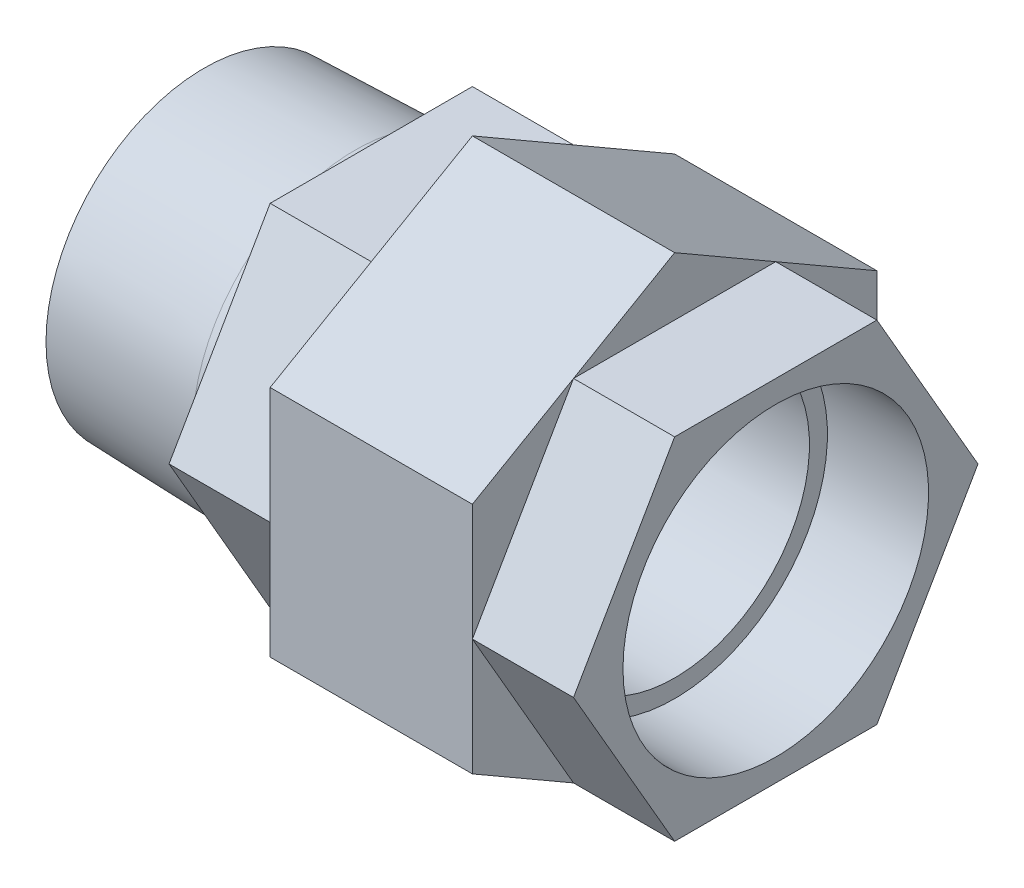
ISO-10303-21;
HEADER;
FILE_DESCRIPTION(('STEP AP214'),'2;1');
FILE_NAME('part.step','',(''),(''),'','','');
FILE_SCHEMA(('AUTOMOTIVE_DESIGN { 1 0 10303 214 1 1 1 1 }'));
ENDSEC;
DATA;
#1=APPLICATION_CONTEXT('core data for automotive mechanical design processes');
#2=APPLICATION_PROTOCOL_DEFINITION('international standard','automotive_design',2000,#1);
#3=PRODUCT_CONTEXT('',#1,'mechanical');
#4=PRODUCT('Part','Part','',(#3));
#5=PRODUCT_RELATED_PRODUCT_CATEGORY('part','',(#4));
#6=PRODUCT_DEFINITION_FORMATION('','',#4);
#7=PRODUCT_DEFINITION_CONTEXT('part definition',#1,'design');
#8=PRODUCT_DEFINITION('design','',#6,#7);
#9=PRODUCT_DEFINITION_SHAPE('','',#8);
#10=(LENGTH_UNIT() NAMED_UNIT(*) SI_UNIT(.MILLI.,.METRE.));
#11=(NAMED_UNIT(*) PLANE_ANGLE_UNIT() SI_UNIT($,.RADIAN.));
#12=(NAMED_UNIT(*) SI_UNIT($,.STERADIAN.) SOLID_ANGLE_UNIT());
#13=UNCERTAINTY_MEASURE_WITH_UNIT(LENGTH_MEASURE(1.E-05),#10,'distance_accuracy_value','');
#14=(GEOMETRIC_REPRESENTATION_CONTEXT(3) GLOBAL_UNCERTAINTY_ASSIGNED_CONTEXT((#13)) GLOBAL_UNIT_ASSIGNED_CONTEXT((#10,
#11,#12)) REPRESENTATION_CONTEXT('',''));
#15=CARTESIAN_POINT('',(0.,0.,0.));
#16=DIRECTION('',(0.,0.,1.));
#17=DIRECTION('',(1.,0.,0.));
#18=AXIS2_PLACEMENT_3D('',#15,#16,#17);
#19=CARTESIAN_POINT('',(63.25,37.5,0.));
#20=DIRECTION('',(-1.,0.,0.));
#21=DIRECTION('',(0.,0.,1.));
#22=AXIS2_PLACEMENT_3D('',#19,#20,#21);
#23=PLANE('',#22);
#24=DIRECTION('',(0.,0.,-1.));
#25=VECTOR('',#24,1.);
#26=CARTESIAN_POINT('',(63.25,-32.4759526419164,18.75));
#27=LINE('',#26,#25);
#28=CARTESIAN_POINT('',(63.25,-32.4759526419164,18.75));
#29=VERTEX_POINT('',#28);
#30=CARTESIAN_POINT('',(63.25,-32.4759526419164,-18.75));
#31=VERTEX_POINT('',#30);
#32=EDGE_CURVE('E171',#29,#31,#27,.T.);
#33=ORIENTED_EDGE('',*,*,#32,.F.);
#34=DIRECTION('',(0.,-0.5,-0.866025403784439));
#35=VECTOR('',#34,1.);
#36=CARTESIAN_POINT('',(63.25,-43.3012701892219,0.));
#37=LINE('',#36,#35);
#38=CARTESIAN_POINT('',(63.25,-43.3012701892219,0.));
#39=VERTEX_POINT('',#38);
#40=EDGE_CURVE('E270',#29,#39,#37,.T.);
#41=ORIENTED_EDGE('',*,*,#40,.T.);
#42=DIRECTION('',(0.,0.5,-0.866025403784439));
#43=VECTOR('',#42,1.);
#44=CARTESIAN_POINT('',(63.25,-21.650635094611,-37.5));
#45=LINE('',#44,#43);
#46=EDGE_CURVE('E267',#39,#31,#45,.T.);
#47=ORIENTED_EDGE('',*,*,#46,.T.);
#48=EDGE_LOOP('',(#33,#41,#47));
#49=FACE_BOUND('',#48,.T.);
#50=ADVANCED_FACE('F34',(#49),#23,.F.);
#51=DIRECTION('',(0.,0.866025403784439,-0.5));
#52=VECTOR('',#51,1.);
#53=CARTESIAN_POINT('',(63.25,-32.4759526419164,-18.75));
#54=LINE('',#53,#52);
#55=CARTESIAN_POINT('',(63.25,0.,-37.5));
#56=VERTEX_POINT('',#55);
#57=EDGE_CURVE('E177',#31,#56,#54,.T.);
#58=ORIENTED_EDGE('',*,*,#57,.F.);
#59=CARTESIAN_POINT('',(63.25,-21.650635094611,-37.5));
#60=VERTEX_POINT('',#59);
#61=EDGE_CURVE('E266',#31,#60,#45,.T.);
#62=ORIENTED_EDGE('',*,*,#61,.T.);
#63=DIRECTION('',(0.,1.,0.));
#64=VECTOR('',#63,1.);
#65=CARTESIAN_POINT('',(63.25,21.6506350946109,-37.5));
#66=LINE('',#65,#64);
#67=EDGE_CURVE('E263',#60,#56,#66,.T.);
#68=ORIENTED_EDGE('',*,*,#67,.T.);
#69=EDGE_LOOP('',(#58,#62,#68));
#70=FACE_BOUND('',#69,.T.);
#71=ADVANCED_FACE('F444',(#70),#23,.F.);
#72=DIRECTION('',(0.,0.866025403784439,0.5));
#73=VECTOR('',#72,1.);
#74=CARTESIAN_POINT('',(63.25,0.,-37.5));
#75=LINE('',#74,#73);
#76=CARTESIAN_POINT('',(63.25,32.4759526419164,-18.75));
#77=VERTEX_POINT('',#76);
#78=EDGE_CURVE('E180',#56,#77,#75,.T.);
#79=ORIENTED_EDGE('',*,*,#78,.F.);
#80=CARTESIAN_POINT('',(63.25,21.6506350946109,-37.5));
#81=VERTEX_POINT('',#80);
#82=EDGE_CURVE('E262',#56,#81,#66,.T.);
#83=ORIENTED_EDGE('',*,*,#82,.T.);
#84=DIRECTION('',(0.,0.5,0.866025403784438));
#85=VECTOR('',#84,1.);
#86=CARTESIAN_POINT('',(63.25,43.3012701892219,0.));
#87=LINE('',#86,#85);
#88=EDGE_CURVE('E259',#81,#77,#87,.T.);
#89=ORIENTED_EDGE('',*,*,#88,.T.);
#90=EDGE_LOOP('',(#79,#83,#89));
#91=FACE_BOUND('',#90,.T.);
#92=ADVANCED_FACE('F436',(#91),#23,.F.);
#93=DIRECTION('',(0.,0.,1.));
#94=VECTOR('',#93,1.);
#95=CARTESIAN_POINT('',(63.25,32.4759526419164,-18.75));
#96=LINE('',#95,#94);
#97=CARTESIAN_POINT('',(63.25,32.4759526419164,18.75));
#98=VERTEX_POINT('',#97);
#99=EDGE_CURVE('E196',#77,#98,#96,.T.);
#100=ORIENTED_EDGE('',*,*,#99,.F.);
#101=CARTESIAN_POINT('',(63.25,43.3012701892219,0.));
#102=VERTEX_POINT('',#101);
#103=EDGE_CURVE('E257',#77,#102,#87,.T.);
#104=ORIENTED_EDGE('',*,*,#103,.T.);
#105=DIRECTION('',(0.,-0.5,0.866025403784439));
#106=VECTOR('',#105,1.);
#107=CARTESIAN_POINT('',(63.25,21.650635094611,37.5));
#108=LINE('',#107,#106);
#109=EDGE_CURVE('E254',#102,#98,#108,.T.);
#110=ORIENTED_EDGE('',*,*,#109,.T.);
#111=EDGE_LOOP('',(#100,#104,#110));
#112=FACE_BOUND('',#111,.T.);
#113=ADVANCED_FACE('F427',(#112),#23,.F.);
#114=DIRECTION('',(0.,-0.866025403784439,0.5));
#115=VECTOR('',#114,1.);
#116=CARTESIAN_POINT('',(63.25,32.4759526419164,18.75));
#117=LINE('',#116,#115);
#118=CARTESIAN_POINT('',(63.25,0.,37.5));
#119=VERTEX_POINT('',#118);
#120=EDGE_CURVE('E57',#98,#119,#117,.T.);
#121=ORIENTED_EDGE('',*,*,#120,.F.);
#122=CARTESIAN_POINT('',(63.25,21.650635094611,37.5));
#123=VERTEX_POINT('',#122);
#124=EDGE_CURVE('E258',#98,#123,#108,.T.);
#125=ORIENTED_EDGE('',*,*,#124,.T.);
#126=DIRECTION('',(0.,-1.,0.));
#127=VECTOR('',#126,1.);
#128=CARTESIAN_POINT('',(63.25,-21.650635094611,37.5));
#129=LINE('',#128,#127);
#130=EDGE_CURVE('E250',#123,#119,#129,.T.);
#131=ORIENTED_EDGE('',*,*,#130,.T.);
#132=EDGE_LOOP('',(#121,#125,#131));
#133=FACE_BOUND('',#132,.T.);
#134=ADVANCED_FACE('F458',(#133),#23,.F.);
#135=DIRECTION('',(0.,-0.866025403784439,-0.5));
#136=VECTOR('',#135,1.);
#137=CARTESIAN_POINT('',(63.25,0.,37.5));
#138=LINE('',#137,#136);
#139=EDGE_CURVE('E49',#119,#29,#138,.T.);
#140=ORIENTED_EDGE('',*,*,#139,.F.);
#141=CARTESIAN_POINT('',(63.25,-21.650635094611,37.5));
#142=VERTEX_POINT('',#141);
#143=EDGE_CURVE('E253',#119,#142,#129,.T.);
#144=ORIENTED_EDGE('',*,*,#143,.T.);
#145=EDGE_CURVE('E271',#142,#29,#37,.T.);
#146=ORIENTED_EDGE('',*,*,#145,.T.);
#147=EDGE_LOOP('',(#140,#144,#146));
#148=FACE_BOUND('',#147,.T.);
#149=ADVANCED_FACE('F462',(#148),#23,.F.);
#150=CARTESIAN_POINT('',(25.75,30.65,0.));
#151=DIRECTION('',(1.,0.,0.));
#152=DIRECTION('',(0.,0.,-1.));
#153=AXIS2_PLACEMENT_3D('',#150,#151,#152);
#154=PLANE('',#153);
#155=DIRECTION('',(0.,1.,0.));
#156=VECTOR('',#155,1.);
#157=CARTESIAN_POINT('',(25.75,-21.650635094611,37.5));
#158=LINE('',#157,#156);
#159=CARTESIAN_POINT('',(25.75,-21.650635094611,37.5));
#160=VERTEX_POINT('',#159);
#161=CARTESIAN_POINT('',(25.75,0.,37.5));
#162=VERTEX_POINT('',#161);
#163=EDGE_CURVE('E277',#160,#162,#158,.T.);
#164=ORIENTED_EDGE('',*,*,#163,.T.);
#165=DIRECTION('',(0.,0.866025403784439,0.5));
#166=VECTOR('',#165,1.);
#167=CARTESIAN_POINT('',(25.75,-32.4759526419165,18.75));
#168=LINE('',#167,#166);
#169=CARTESIAN_POINT('',(25.75,-32.4759526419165,18.75));
#170=VERTEX_POINT('',#169);
#171=EDGE_CURVE('E225',#170,#162,#168,.T.);
#172=ORIENTED_EDGE('',*,*,#171,.F.);
#173=DIRECTION('',(0.,0.5,0.866025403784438));
#174=VECTOR('',#173,1.);
#175=CARTESIAN_POINT('',(25.75,-43.3012701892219,0.));
#176=LINE('',#175,#174);
#177=EDGE_CURVE('E204',#170,#160,#176,.T.);
#178=ORIENTED_EDGE('',*,*,#177,.T.);
#179=EDGE_LOOP('',(#164,#172,#178));
#180=FACE_BOUND('',#179,.T.);
#181=ADVANCED_FACE('F381',(#180),#154,.F.);
#182=CARTESIAN_POINT('',(25.75,-43.3012701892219,0.));
#183=VERTEX_POINT('',#182);
#184=EDGE_CURVE('E273',#183,#170,#176,.T.);
#185=ORIENTED_EDGE('',*,*,#184,.T.);
#186=DIRECTION('',(0.,0.,1.));
#187=VECTOR('',#186,1.);
#188=CARTESIAN_POINT('',(25.75,-32.4759526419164,-18.75));
#189=LINE('',#188,#187);
#190=CARTESIAN_POINT('',(25.75,-32.4759526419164,-18.75));
#191=VERTEX_POINT('',#190);
#192=EDGE_CURVE('E229',#191,#170,#189,.T.);
#193=ORIENTED_EDGE('',*,*,#192,.F.);
#194=DIRECTION('',(0.,-0.5,0.866025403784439));
#195=VECTOR('',#194,1.);
#196=CARTESIAN_POINT('',(25.75,-21.650635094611,-37.5));
#197=LINE('',#196,#195);
#198=EDGE_CURVE('E292',#191,#183,#197,.T.);
#199=ORIENTED_EDGE('',*,*,#198,.T.);
#200=EDGE_LOOP('',(#185,#193,#199));
#201=FACE_BOUND('',#200,.T.);
#202=ADVANCED_FACE('F389',(#201),#154,.F.);
#203=CARTESIAN_POINT('',(25.75,-21.650635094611,-37.5));
#204=VERTEX_POINT('',#203);
#205=EDGE_CURVE('E293',#204,#191,#197,.T.);
#206=ORIENTED_EDGE('',*,*,#205,.T.);
#207=DIRECTION('',(0.,-0.866025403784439,0.5));
#208=VECTOR('',#207,1.);
#209=CARTESIAN_POINT('',(25.75,0.,-37.5));
#210=LINE('',#209,#208);
#211=CARTESIAN_POINT('',(25.75,0.,-37.5));
#212=VERTEX_POINT('',#211);
#213=EDGE_CURVE('E233',#212,#191,#210,.T.);
#214=ORIENTED_EDGE('',*,*,#213,.F.);
#215=DIRECTION('',(0.,-1.,0.));
#216=VECTOR('',#215,1.);
#217=CARTESIAN_POINT('',(25.75,21.6506350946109,-37.5));
#218=LINE('',#217,#216);
#219=EDGE_CURVE('E288',#212,#204,#218,.T.);
#220=ORIENTED_EDGE('',*,*,#219,.T.);
#221=EDGE_LOOP('',(#206,#214,#220));
#222=FACE_BOUND('',#221,.T.);
#223=ADVANCED_FACE('F699',(#222),#154,.F.);
#224=CARTESIAN_POINT('',(25.75,21.6506350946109,-37.5));
#225=VERTEX_POINT('',#224);
#226=EDGE_CURVE('E289',#225,#212,#218,.T.);
#227=ORIENTED_EDGE('',*,*,#226,.T.);
#228=DIRECTION('',(0.,-0.866025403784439,-0.5));
#229=VECTOR('',#228,1.);
#230=CARTESIAN_POINT('',(25.75,32.4759526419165,-18.75));
#231=LINE('',#230,#229);
#232=CARTESIAN_POINT('',(25.75,32.4759526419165,-18.75));
#233=VERTEX_POINT('',#232);
#234=EDGE_CURVE('E237',#233,#212,#231,.T.);
#235=ORIENTED_EDGE('',*,*,#234,.F.);
#236=DIRECTION('',(0.,-0.5,-0.866025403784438));
#237=VECTOR('',#236,1.);
#238=CARTESIAN_POINT('',(25.75,43.3012701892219,0.));
#239=LINE('',#238,#237);
#240=EDGE_CURVE('E284',#233,#225,#239,.T.);
#241=ORIENTED_EDGE('',*,*,#240,.T.);
#242=EDGE_LOOP('',(#227,#235,#241));
#243=FACE_BOUND('',#242,.T.);
#244=ADVANCED_FACE('F448',(#243),#154,.F.);
#245=CARTESIAN_POINT('',(25.75,43.3012701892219,0.));
#246=VERTEX_POINT('',#245);
#247=EDGE_CURVE('E285',#246,#233,#239,.T.);
#248=ORIENTED_EDGE('',*,*,#247,.T.);
#249=DIRECTION('',(0.,0.,-1.));
#250=VECTOR('',#249,1.);
#251=CARTESIAN_POINT('',(25.75,32.4759526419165,18.75));
#252=LINE('',#251,#250);
#253=CARTESIAN_POINT('',(25.75,32.4759526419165,18.75));
#254=VERTEX_POINT('',#253);
#255=EDGE_CURVE('E241',#254,#233,#252,.T.);
#256=ORIENTED_EDGE('',*,*,#255,.F.);
#257=DIRECTION('',(0.,0.5,-0.866025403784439));
#258=VECTOR('',#257,1.);
#259=CARTESIAN_POINT('',(25.75,21.650635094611,37.5));
#260=LINE('',#259,#258);
#261=EDGE_CURVE('E280',#254,#246,#260,.T.);
#262=ORIENTED_EDGE('',*,*,#261,.T.);
#263=EDGE_LOOP('',(#248,#256,#262));
#264=FACE_BOUND('',#263,.T.);
#265=ADVANCED_FACE('F451',(#264),#154,.F.);
#266=CARTESIAN_POINT('',(-65.3489260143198,0.,0.));
#267=DIRECTION('',(-1.,0.,0.));
#268=DIRECTION('',(0.,0.,1.));
#269=AXIS2_PLACEMENT_3D('',#266,#267,#268);
#270=CYLINDRICAL_SURFACE('',#269,25.);
#271=CARTESIAN_POINT('',(63.25,0.,0.));
#272=DIRECTION('',(-1.,0.,0.));
#273=DIRECTION('',(0.,0.,1.));
#274=AXIS2_PLACEMENT_3D('',#271,#272,#273);
#275=CIRCLE('',#274,25.);
#276=CARTESIAN_POINT('',(63.25,0.,25.));
#277=VERTEX_POINT('',#276);
#278=EDGE_CURVE('E252',#277,#277,#275,.F.);
#279=ORIENTED_EDGE('',*,*,#278,.T.);
#280=EDGE_LOOP('',(#279));
#281=FACE_BOUND('',#280,.T.);
#282=CARTESIAN_POINT('',(-24.,0.,0.));
#283=DIRECTION('',(-1.,0.,0.));
#284=DIRECTION('',(0.,0.,1.));
#285=AXIS2_PLACEMENT_3D('',#282,#283,#284);
#286=CIRCLE('',#285,25.);
#287=CARTESIAN_POINT('',(-24.,0.,25.));
#288=VERTEX_POINT('',#287);
#289=EDGE_CURVE('E42',#288,#288,#286,.T.);
#290=ORIENTED_EDGE('',*,*,#289,.T.);
#291=EDGE_LOOP('',(#290));
#292=FACE_BOUND('',#291,.T.);
#293=ADVANCED_FACE('F36',(#281,#292),#270,.F.);
#294=CARTESIAN_POINT('',(-24.,25.,0.));
#295=DIRECTION('',(1.,0.,0.));
#296=DIRECTION('',(0.,0.,-1.));
#297=AXIS2_PLACEMENT_3D('',#294,#295,#296);
#298=PLANE('',#297);
#299=ORIENTED_EDGE('',*,*,#289,.F.);
#300=EDGE_LOOP('',(#299));
#301=FACE_BOUND('',#300,.T.);
#302=CARTESIAN_POINT('',(-24.,0.,0.));
#303=DIRECTION('',(-1.,0.,0.));
#304=DIRECTION('',(0.,0.,1.));
#305=AXIS2_PLACEMENT_3D('',#302,#303,#304);
#306=CIRCLE('',#305,29.3105);
#307=CARTESIAN_POINT('',(-24.,0.,29.3105));
#308=VERTEX_POINT('',#307);
#309=EDGE_CURVE('E325',#308,#308,#306,.T.);
#310=ORIENTED_EDGE('',*,*,#309,.T.);
#311=EDGE_LOOP('',(#310));
#312=FACE_BOUND('',#311,.T.);
#313=ADVANCED_FACE('F331',(#301,#312),#298,.F.);
#314=CARTESIAN_POINT('',(4.,0.,0.));
#315=DIRECTION('',(1.,0.,0.));
#316=DIRECTION('',(0.,0.,-1.));
#317=AXIS2_PLACEMENT_3D('',#314,#315,#316);
#318=CONICAL_SURFACE('',#317,30.15,0.0299731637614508);
#319=ORIENTED_EDGE('',*,*,#309,.F.);
#320=EDGE_LOOP('',(#319));
#321=FACE_BOUND('',#320,.T.);
#322=CARTESIAN_POINT('',(4.,0.,0.));
#323=DIRECTION('',(-1.,0.,0.));
#324=DIRECTION('',(0.,0.,1.));
#325=AXIS2_PLACEMENT_3D('',#322,#323,#324);
#326=CIRCLE('',#325,30.15);
#327=CARTESIAN_POINT('',(4.,0.,30.15));
#328=VERTEX_POINT('',#327);
#329=EDGE_CURVE('E322',#328,#328,#326,.T.);
#330=ORIENTED_EDGE('',*,*,#329,.T.);
#331=EDGE_LOOP('',(#330));
#332=FACE_BOUND('',#331,.T.);
#333=ADVANCED_FACE('F334',(#321,#332),#318,.T.);
#334=CARTESIAN_POINT('',(-65.3489260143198,0.,0.));
#335=DIRECTION('',(-1.,0.,0.));
#336=DIRECTION('',(0.,0.,1.));
#337=AXIS2_PLACEMENT_3D('',#334,#335,#336);
#338=CYLINDRICAL_SURFACE('',#337,30.15);
#339=ORIENTED_EDGE('',*,*,#329,.F.);
#340=EDGE_LOOP('',(#339));
#341=FACE_BOUND('',#340,.T.);
#342=CARTESIAN_POINT('',(7.00000000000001,0.,0.));
#343=DIRECTION('',(-1.,0.,0.));
#344=DIRECTION('',(0.,0.,1.));
#345=AXIS2_PLACEMENT_3D('',#342,#343,#344);
#346=CIRCLE('',#345,30.15);
#347=CARTESIAN_POINT('',(7.00000000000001,0.,30.15));
#348=VERTEX_POINT('',#347);
#349=EDGE_CURVE('E319',#348,#348,#346,.T.);
#350=ORIENTED_EDGE('',*,*,#349,.T.);
#351=EDGE_LOOP('',(#350));
#352=FACE_BOUND('',#351,.T.);
#353=ADVANCED_FACE('F339',(#341,#352),#338,.T.);
#354=CARTESIAN_POINT('',(7.00000000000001,30.15,0.));
#355=DIRECTION('',(1.,0.,0.));
#356=DIRECTION('',(0.,0.,-1.));
#357=AXIS2_PLACEMENT_3D('',#354,#355,#356);
#358=PLANE('',#357);
#359=ORIENTED_EDGE('',*,*,#349,.F.);
#360=EDGE_LOOP('',(#359));
#361=FACE_BOUND('',#360,.T.);
#362=DIRECTION('',(0.,0.866025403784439,0.5));
#363=VECTOR('',#362,1.);
#364=CARTESIAN_POINT('',(7.00000000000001,-32.4759526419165,18.75));
#365=LINE('',#364,#363);
#366=CARTESIAN_POINT('',(7.00000000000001,-32.4759526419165,18.75));
#367=VERTEX_POINT('',#366);
#368=CARTESIAN_POINT('',(7.00000000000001,0.,37.5));
#369=VERTEX_POINT('',#368);
#370=EDGE_CURVE('E217',#367,#369,#365,.T.);
#371=ORIENTED_EDGE('',*,*,#370,.T.);
#372=DIRECTION('',(0.,0.866025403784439,-0.5));
#373=VECTOR('',#372,1.);
#374=CARTESIAN_POINT('',(7.00000000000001,0.,37.5));
#375=LINE('',#374,#373);
#376=CARTESIAN_POINT('',(7.00000000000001,32.4759526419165,18.75));
#377=VERTEX_POINT('',#376);
#378=EDGE_CURVE('E214',#369,#377,#375,.T.);
#379=ORIENTED_EDGE('',*,*,#378,.T.);
#380=DIRECTION('',(0.,0.,-1.));
#381=VECTOR('',#380,1.);
#382=CARTESIAN_POINT('',(7.00000000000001,32.4759526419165,18.75));
#383=LINE('',#382,#381);
#384=CARTESIAN_POINT('',(7.00000000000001,32.4759526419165,-18.75));
#385=VERTEX_POINT('',#384);
#386=EDGE_CURVE('E211',#377,#385,#383,.T.);
#387=ORIENTED_EDGE('',*,*,#386,.T.);
#388=DIRECTION('',(0.,-0.866025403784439,-0.5));
#389=VECTOR('',#388,1.);
#390=CARTESIAN_POINT('',(7.00000000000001,32.4759526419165,-18.75));
#391=LINE('',#390,#389);
#392=CARTESIAN_POINT('',(7.00000000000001,0.,-37.5));
#393=VERTEX_POINT('',#392);
#394=EDGE_CURVE('E208',#385,#393,#391,.T.);
#395=ORIENTED_EDGE('',*,*,#394,.T.);
#396=DIRECTION('',(0.,-0.866025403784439,0.5));
#397=VECTOR('',#396,1.);
#398=CARTESIAN_POINT('',(7.00000000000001,0.,-37.5));
#399=LINE('',#398,#397);
#400=CARTESIAN_POINT('',(7.00000000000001,-32.4759526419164,-18.75));
#401=VERTEX_POINT('',#400);
#402=EDGE_CURVE('E205',#393,#401,#399,.T.);
#403=ORIENTED_EDGE('',*,*,#402,.T.);
#404=DIRECTION('',(0.,0.,1.));
#405=VECTOR('',#404,1.);
#406=CARTESIAN_POINT('',(7.00000000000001,-32.4759526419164,-18.75));
#407=LINE('',#406,#405);
#408=EDGE_CURVE('E201',#401,#367,#407,.T.);
#409=ORIENTED_EDGE('',*,*,#408,.T.);
#410=EDGE_LOOP('',(#371,#379,#387,#395,#403,#409));
#411=FACE_BOUND('',#410,.T.);
#412=ADVANCED_FACE('F345',(#361,#411),#358,.F.);
#413=CARTESIAN_POINT('',(25.75,21.650635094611,37.5));
#414=VERTEX_POINT('',#413);
#415=EDGE_CURVE('E281',#414,#254,#260,.T.);
#416=ORIENTED_EDGE('',*,*,#415,.T.);
#417=DIRECTION('',(0.,0.866025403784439,-0.5));
#418=VECTOR('',#417,1.);
#419=CARTESIAN_POINT('',(25.75,0.,37.5));
#420=LINE('',#419,#418);
#421=EDGE_CURVE('E221',#162,#254,#420,.T.);
#422=ORIENTED_EDGE('',*,*,#421,.F.);
#423=EDGE_CURVE('E276',#162,#414,#158,.T.);
#424=ORIENTED_EDGE('',*,*,#423,.T.);
#425=EDGE_LOOP('',(#416,#422,#424));
#426=FACE_BOUND('',#425,.T.);
#427=ADVANCED_FACE('F351',(#426),#154,.F.);
#428=ORIENTED_EDGE('',*,*,#278,.F.);
#429=EDGE_LOOP('',(#428));
#430=FACE_BOUND('',#429,.T.);
#431=CARTESIAN_POINT('',(63.25,0.,0.));
#432=DIRECTION('',(-1.,0.,0.));
#433=DIRECTION('',(0.,0.,1.));
#434=AXIS2_PLACEMENT_3D('',#431,#432,#433);
#435=CIRCLE('',#434,28.3295);
#436=CARTESIAN_POINT('',(63.25,0.,28.3295));
#437=VERTEX_POINT('',#436);
#438=EDGE_CURVE('E11',#437,#437,#435,.F.);
#439=ORIENTED_EDGE('',*,*,#438,.T.);
#440=EDGE_LOOP('',(#439));
#441=FACE_BOUND('',#440,.T.);
#442=ADVANCED_FACE('F465',(#430,#441),#23,.F.);
#443=CARTESIAN_POINT('',(82.,30.65,0.));
#444=DIRECTION('',(-1.,0.,0.));
#445=DIRECTION('',(0.,0.,1.));
#446=AXIS2_PLACEMENT_3D('',#443,#444,#445);
#447=PLANE('',#446);
#448=CARTESIAN_POINT('',(82.,0.,0.));
#449=DIRECTION('',(-1.,0.,0.));
#450=DIRECTION('',(0.,0.,1.));
#451=AXIS2_PLACEMENT_3D('',#448,#449,#450);
#452=CIRCLE('',#451,28.3295);
#453=CARTESIAN_POINT('',(82.,0.,28.3295));
#454=VERTEX_POINT('',#453);
#455=EDGE_CURVE('E316',#454,#454,#452,.T.);
#456=ORIENTED_EDGE('',*,*,#455,.T.);
#457=EDGE_LOOP('',(#456));
#458=FACE_BOUND('',#457,.T.);
#459=DIRECTION('',(0.,-0.866025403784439,0.5));
#460=VECTOR('',#459,1.);
#461=CARTESIAN_POINT('',(82.,-32.4759526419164,-18.75));
#462=LINE('',#461,#460);
#463=CARTESIAN_POINT('',(82.,0.,-37.5));
#464=VERTEX_POINT('',#463);
#465=CARTESIAN_POINT('',(82.,-32.4759526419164,-18.75));
#466=VERTEX_POINT('',#465);
#467=EDGE_CURVE('E159',#464,#466,#462,.T.);
#468=ORIENTED_EDGE('',*,*,#467,.F.);
#469=DIRECTION('',(0.,-0.866025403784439,-0.5));
#470=VECTOR('',#469,1.);
#471=CARTESIAN_POINT('',(82.,0.,-37.5));
#472=LINE('',#471,#470);
#473=CARTESIAN_POINT('',(82.,32.4759526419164,-18.75));
#474=VERTEX_POINT('',#473);
#475=EDGE_CURVE('E163',#474,#464,#472,.T.);
#476=ORIENTED_EDGE('',*,*,#475,.F.);
#477=DIRECTION('',(0.,0.,-1.));
#478=VECTOR('',#477,1.);
#479=CARTESIAN_POINT('',(82.,32.4759526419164,-18.75));
#480=LINE('',#479,#478);
#481=CARTESIAN_POINT('',(82.,32.4759526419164,18.75));
#482=VERTEX_POINT('',#481);
#483=EDGE_CURVE('E190',#482,#474,#480,.T.);
#484=ORIENTED_EDGE('',*,*,#483,.F.);
#485=DIRECTION('',(0.,0.866025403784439,-0.5));
#486=VECTOR('',#485,1.);
#487=CARTESIAN_POINT('',(82.,32.4759526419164,18.75));
#488=LINE('',#487,#486);
#489=CARTESIAN_POINT('',(82.,0.,37.5));
#490=VERTEX_POINT('',#489);
#491=EDGE_CURVE('E192',#490,#482,#488,.T.);
#492=ORIENTED_EDGE('',*,*,#491,.F.);
#493=DIRECTION('',(0.,0.866025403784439,0.5));
#494=VECTOR('',#493,1.);
#495=CARTESIAN_POINT('',(82.,0.,37.5));
#496=LINE('',#495,#494);
#497=CARTESIAN_POINT('',(82.,-32.4759526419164,18.75));
#498=VERTEX_POINT('',#497);
#499=EDGE_CURVE('E197',#498,#490,#496,.T.);
#500=ORIENTED_EDGE('',*,*,#499,.F.);
#501=DIRECTION('',(0.,0.,1.));
#502=VECTOR('',#501,1.);
#503=CARTESIAN_POINT('',(82.,-32.4759526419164,18.75));
#504=LINE('',#503,#502);
#505=EDGE_CURVE('E166',#466,#498,#504,.T.);
#506=ORIENTED_EDGE('',*,*,#505,.F.);
#507=EDGE_LOOP('',(#468,#476,#484,#492,#500,#506));
#508=FACE_BOUND('',#507,.T.);
#509=ADVANCED_FACE('F161',(#458,#508),#447,.F.);
#510=CARTESIAN_POINT('',(-65.3489260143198,0.,0.));
#511=DIRECTION('',(-1.,0.,0.));
#512=DIRECTION('',(0.,0.,1.));
#513=AXIS2_PLACEMENT_3D('',#510,#511,#512);
#514=CYLINDRICAL_SURFACE('',#513,28.3295);
#515=ORIENTED_EDGE('',*,*,#455,.F.);
#516=EDGE_LOOP('',(#515));
#517=FACE_BOUND('',#516,.T.);
#518=ORIENTED_EDGE('',*,*,#438,.F.);
#519=EDGE_LOOP('',(#518));
#520=FACE_BOUND('',#519,.T.);
#521=ADVANCED_FACE('F506',(#517,#520),#514,.F.);
#522=CARTESIAN_POINT('',(177.814392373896,-21.650635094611,37.5));
#523=DIRECTION('',(0.,0.,1.));
#524=DIRECTION('',(0.,-1.,0.));
#525=AXIS2_PLACEMENT_3D('',#522,#523,#524);
#526=PLANE('',#525);
#527=ORIENTED_EDGE('',*,*,#163,.F.);
#528=DIRECTION('',(-1.,0.,0.));
#529=VECTOR('',#528,1.);
#530=CARTESIAN_POINT('',(177.814392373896,-21.650635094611,37.5));
#531=LINE('',#530,#529);
#532=EDGE_CURVE('E296',#142,#160,#531,.T.);
#533=ORIENTED_EDGE('',*,*,#532,.F.);
#534=ORIENTED_EDGE('',*,*,#143,.F.);
#535=ORIENTED_EDGE('',*,*,#130,.F.);
#536=DIRECTION('',(-1.,0.,0.));
#537=VECTOR('',#536,1.);
#538=CARTESIAN_POINT('',(177.814392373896,21.650635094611,37.5));
#539=LINE('',#538,#537);
#540=EDGE_CURVE('E309',#123,#414,#539,.T.);
#541=ORIENTED_EDGE('',*,*,#540,.T.);
#542=ORIENTED_EDGE('',*,*,#423,.F.);
#543=EDGE_LOOP('',(#527,#533,#534,#535,#541,#542));
#544=FACE_BOUND('',#543,.T.);
#545=ADVANCED_FACE('F460',(#544),#526,.T.);
#546=CARTESIAN_POINT('',(177.814392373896,21.650635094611,37.5));
#547=DIRECTION('',(0.,0.866025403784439,0.5));
#548=DIRECTION('',(0.,-0.5,0.866025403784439));
#549=AXIS2_PLACEMENT_3D('',#546,#547,#548);
#550=PLANE('',#549);
#551=DIRECTION('',(-1.,0.,0.));
#552=VECTOR('',#551,1.);
#553=CARTESIAN_POINT('',(177.814392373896,43.3012701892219,0.));
#554=LINE('',#553,#552);
#555=EDGE_CURVE('E306',#102,#246,#554,.T.);
#556=ORIENTED_EDGE('',*,*,#555,.T.);
#557=ORIENTED_EDGE('',*,*,#261,.F.);
#558=ORIENTED_EDGE('',*,*,#415,.F.);
#559=ORIENTED_EDGE('',*,*,#540,.F.);
#560=ORIENTED_EDGE('',*,*,#124,.F.);
#561=ORIENTED_EDGE('',*,*,#109,.F.);
#562=EDGE_LOOP('',(#556,#557,#558,#559,#560,#561));
#563=FACE_BOUND('',#562,.T.);
#564=ADVANCED_FACE('F455',(#563),#550,.T.);
#565=CARTESIAN_POINT('',(177.814392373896,43.3012701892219,0.));
#566=DIRECTION('',(0.,0.866025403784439,-0.5));
#567=DIRECTION('',(0.,0.5,0.866025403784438));
#568=AXIS2_PLACEMENT_3D('',#565,#566,#567);
#569=PLANE('',#568);
#570=DIRECTION('',(-1.,0.,0.));
#571=VECTOR('',#570,1.);
#572=CARTESIAN_POINT('',(177.814392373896,21.6506350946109,-37.5));
#573=LINE('',#572,#571);
#574=EDGE_CURVE('E303',#81,#225,#573,.T.);
#575=ORIENTED_EDGE('',*,*,#574,.T.);
#576=ORIENTED_EDGE('',*,*,#240,.F.);
#577=ORIENTED_EDGE('',*,*,#247,.F.);
#578=ORIENTED_EDGE('',*,*,#555,.F.);
#579=ORIENTED_EDGE('',*,*,#103,.F.);
#580=ORIENTED_EDGE('',*,*,#88,.F.);
#581=EDGE_LOOP('',(#575,#576,#577,#578,#579,#580));
#582=FACE_BOUND('',#581,.T.);
#583=ADVANCED_FACE('F432',(#582),#569,.T.);
#584=CARTESIAN_POINT('',(177.814392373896,21.6506350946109,-37.5));
#585=DIRECTION('',(0.,0.,-1.));
#586=DIRECTION('',(-1.,0.,0.));
#587=AXIS2_PLACEMENT_3D('',#584,#585,#586);
#588=PLANE('',#587);
#589=DIRECTION('',(-1.,0.,0.));
#590=VECTOR('',#589,1.);
#591=CARTESIAN_POINT('',(177.814392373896,-21.650635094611,-37.5));
#592=LINE('',#591,#590);
#593=EDGE_CURVE('E300',#60,#204,#592,.T.);
#594=ORIENTED_EDGE('',*,*,#593,.T.);
#595=ORIENTED_EDGE('',*,*,#219,.F.);
#596=ORIENTED_EDGE('',*,*,#226,.F.);
#597=ORIENTED_EDGE('',*,*,#574,.F.);
#598=ORIENTED_EDGE('',*,*,#82,.F.);
#599=ORIENTED_EDGE('',*,*,#67,.F.);
#600=EDGE_LOOP('',(#594,#595,#596,#597,#598,#599));
#601=FACE_BOUND('',#600,.T.);
#602=ADVANCED_FACE('F440',(#601),#588,.T.);
#603=CARTESIAN_POINT('',(177.814392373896,-21.650635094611,-37.5));
#604=DIRECTION('',(0.,-0.866025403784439,-0.5));
#605=DIRECTION('',(0.,0.5,-0.866025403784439));
#606=AXIS2_PLACEMENT_3D('',#603,#604,#605);
#607=PLANE('',#606);
#608=DIRECTION('',(-1.,0.,0.));
#609=VECTOR('',#608,1.);
#610=CARTESIAN_POINT('',(177.814392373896,-43.3012701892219,0.));
#611=LINE('',#610,#609);
#612=EDGE_CURVE('E297',#39,#183,#611,.T.);
#613=ORIENTED_EDGE('',*,*,#612,.T.);
#614=ORIENTED_EDGE('',*,*,#198,.F.);
#615=ORIENTED_EDGE('',*,*,#205,.F.);
#616=ORIENTED_EDGE('',*,*,#593,.F.);
#617=ORIENTED_EDGE('',*,*,#61,.F.);
#618=ORIENTED_EDGE('',*,*,#46,.F.);
#619=EDGE_LOOP('',(#613,#614,#615,#616,#617,#618));
#620=FACE_BOUND('',#619,.T.);
#621=ADVANCED_FACE('F393',(#620),#607,.T.);
#622=CARTESIAN_POINT('',(177.814392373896,-43.3012701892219,0.));
#623=DIRECTION('',(0.,-0.866025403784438,0.5));
#624=DIRECTION('',(0.,-0.5,-0.866025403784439));
#625=AXIS2_PLACEMENT_3D('',#622,#623,#624);
#626=PLANE('',#625);
#627=ORIENTED_EDGE('',*,*,#532,.T.);
#628=ORIENTED_EDGE('',*,*,#177,.F.);
#629=ORIENTED_EDGE('',*,*,#184,.F.);
#630=ORIENTED_EDGE('',*,*,#612,.F.);
#631=ORIENTED_EDGE('',*,*,#40,.F.);
#632=ORIENTED_EDGE('',*,*,#145,.F.);
#633=EDGE_LOOP('',(#627,#628,#629,#630,#631,#632));
#634=FACE_BOUND('',#633,.T.);
#635=ADVANCED_FACE('F385',(#634),#626,.T.);
#636=CARTESIAN_POINT('',(124.965674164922,-32.4759526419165,18.75));
#637=DIRECTION('',(0.,-0.5,0.866025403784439));
#638=DIRECTION('',(0.,-0.866025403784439,-0.5));
#639=AXIS2_PLACEMENT_3D('',#636,#637,#638);
#640=PLANE('',#639);
#641=DIRECTION('',(-1.,0.,0.));
#642=VECTOR('',#641,1.);
#643=CARTESIAN_POINT('',(124.965674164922,-32.4759526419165,18.75));
#644=LINE('',#643,#642);
#645=EDGE_CURVE('E232',#170,#367,#644,.T.);
#646=ORIENTED_EDGE('',*,*,#645,.F.);
#647=ORIENTED_EDGE('',*,*,#171,.T.);
#648=DIRECTION('',(-1.,0.,0.));
#649=VECTOR('',#648,1.);
#650=CARTESIAN_POINT('',(124.965674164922,0.,37.5));
#651=LINE('',#650,#649);
#652=EDGE_CURVE('E228',#162,#369,#651,.T.);
#653=ORIENTED_EDGE('',*,*,#652,.T.);
#654=ORIENTED_EDGE('',*,*,#370,.F.);
#655=EDGE_LOOP('',(#646,#647,#653,#654));
#656=FACE_BOUND('',#655,.T.);
#657=ADVANCED_FACE('F357',(#656),#640,.T.);
#658=CARTESIAN_POINT('',(124.965674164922,-32.4759526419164,-18.75));
#659=DIRECTION('',(0.,-1.,0.));
#660=DIRECTION('',(0.,0.,-1.));
#661=AXIS2_PLACEMENT_3D('',#658,#659,#660);
#662=PLANE('',#661);
#663=DIRECTION('',(-1.,0.,0.));
#664=VECTOR('',#663,1.);
#665=CARTESIAN_POINT('',(124.965674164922,-32.4759526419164,-18.75));
#666=LINE('',#665,#664);
#667=EDGE_CURVE('E236',#191,#401,#666,.T.);
#668=ORIENTED_EDGE('',*,*,#667,.F.);
#669=ORIENTED_EDGE('',*,*,#192,.T.);
#670=ORIENTED_EDGE('',*,*,#645,.T.);
#671=ORIENTED_EDGE('',*,*,#408,.F.);
#672=EDGE_LOOP('',(#668,#669,#670,#671));
#673=FACE_BOUND('',#672,.T.);
#674=ADVANCED_FACE('F376',(#673),#662,.T.);
#675=CARTESIAN_POINT('',(124.965674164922,0.,-37.5));
#676=DIRECTION('',(0.,-0.5,-0.866025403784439));
#677=DIRECTION('',(0.,0.866025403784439,-0.5));
#678=AXIS2_PLACEMENT_3D('',#675,#676,#677);
#679=PLANE('',#678);
#680=DIRECTION('',(-1.,0.,0.));
#681=VECTOR('',#680,1.);
#682=CARTESIAN_POINT('',(124.965674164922,0.,-37.5));
#683=LINE('',#682,#681);
#684=EDGE_CURVE('E240',#212,#393,#683,.T.);
#685=ORIENTED_EDGE('',*,*,#684,.F.);
#686=ORIENTED_EDGE('',*,*,#213,.T.);
#687=ORIENTED_EDGE('',*,*,#667,.T.);
#688=ORIENTED_EDGE('',*,*,#402,.F.);
#689=EDGE_LOOP('',(#685,#686,#687,#688));
#690=FACE_BOUND('',#689,.T.);
#691=ADVANCED_FACE('F373',(#690),#679,.T.);
#692=CARTESIAN_POINT('',(124.965674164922,32.4759526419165,-18.75));
#693=DIRECTION('',(0.,0.5,-0.866025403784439));
#694=DIRECTION('',(0.,0.866025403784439,0.5));
#695=AXIS2_PLACEMENT_3D('',#692,#693,#694);
#696=PLANE('',#695);
#697=DIRECTION('',(-1.,0.,0.));
#698=VECTOR('',#697,1.);
#699=CARTESIAN_POINT('',(124.965674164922,32.4759526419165,-18.75));
#700=LINE('',#699,#698);
#701=EDGE_CURVE('E224',#233,#385,#700,.T.);
#702=ORIENTED_EDGE('',*,*,#701,.F.);
#703=ORIENTED_EDGE('',*,*,#234,.T.);
#704=ORIENTED_EDGE('',*,*,#684,.T.);
#705=ORIENTED_EDGE('',*,*,#394,.F.);
#706=EDGE_LOOP('',(#702,#703,#704,#705));
#707=FACE_BOUND('',#706,.T.);
#708=ADVANCED_FACE('F369',(#707),#696,.T.);
#709=CARTESIAN_POINT('',(124.965674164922,32.4759526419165,18.75));
#710=DIRECTION('',(0.,1.,0.));
#711=DIRECTION('',(0.,0.,1.));
#712=AXIS2_PLACEMENT_3D('',#709,#710,#711);
#713=PLANE('',#712);
#714=DIRECTION('',(-1.,0.,0.));
#715=VECTOR('',#714,1.);
#716=CARTESIAN_POINT('',(124.965674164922,32.4759526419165,18.75));
#717=LINE('',#716,#715);
#718=EDGE_CURVE('E220',#254,#377,#717,.T.);
#719=ORIENTED_EDGE('',*,*,#718,.F.);
#720=ORIENTED_EDGE('',*,*,#255,.T.);
#721=ORIENTED_EDGE('',*,*,#701,.T.);
#722=ORIENTED_EDGE('',*,*,#386,.F.);
#723=EDGE_LOOP('',(#719,#720,#721,#722));
#724=FACE_BOUND('',#723,.T.);
#725=ADVANCED_FACE('F365',(#724),#713,.T.);
#726=CARTESIAN_POINT('',(124.965674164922,0.,37.5));
#727=DIRECTION('',(0.,0.5,0.866025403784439));
#728=DIRECTION('',(0.,-0.866025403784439,0.5));
#729=AXIS2_PLACEMENT_3D('',#726,#727,#728);
#730=PLANE('',#729);
#731=ORIENTED_EDGE('',*,*,#652,.F.);
#732=ORIENTED_EDGE('',*,*,#421,.T.);
#733=ORIENTED_EDGE('',*,*,#718,.T.);
#734=ORIENTED_EDGE('',*,*,#378,.F.);
#735=EDGE_LOOP('',(#731,#732,#733,#734));
#736=FACE_BOUND('',#735,.T.);
#737=ADVANCED_FACE('F361',(#736),#730,.T.);
#738=CARTESIAN_POINT('',(181.215674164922,-32.4759526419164,18.75));
#739=DIRECTION('',(0.,1.,0.));
#740=DIRECTION('',(0.,0.,1.));
#741=AXIS2_PLACEMENT_3D('',#738,#739,#740);
#742=PLANE('',#741);
#743=DIRECTION('',(-1.,0.,0.));
#744=VECTOR('',#743,1.);
#745=CARTESIAN_POINT('',(181.215674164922,-32.4759526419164,-18.75));
#746=LINE('',#745,#744);
#747=EDGE_CURVE('E170',#466,#31,#746,.T.);
#748=ORIENTED_EDGE('',*,*,#747,.F.);
#749=ORIENTED_EDGE('',*,*,#505,.T.);
#750=DIRECTION('',(-1.,0.,0.));
#751=VECTOR('',#750,1.);
#752=CARTESIAN_POINT('',(181.215674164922,-32.4759526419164,18.75));
#753=LINE('',#752,#751);
#754=EDGE_CURVE('E401',#498,#29,#753,.T.);
#755=ORIENTED_EDGE('',*,*,#754,.T.);
#756=ORIENTED_EDGE('',*,*,#32,.T.);
#757=EDGE_LOOP('',(#748,#749,#755,#756));
#758=FACE_BOUND('',#757,.T.);
#759=ADVANCED_FACE('F404',(#758),#742,.F.);
#760=CARTESIAN_POINT('',(181.215674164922,-32.4759526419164,-18.75));
#761=DIRECTION('',(0.,0.5,0.866025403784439));
#762=DIRECTION('',(0.,-0.866025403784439,0.5));
#763=AXIS2_PLACEMENT_3D('',#760,#761,#762);
#764=PLANE('',#763);
#765=DIRECTION('',(-1.,0.,0.));
#766=VECTOR('',#765,1.);
#767=CARTESIAN_POINT('',(181.215674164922,0.,-37.5));
#768=LINE('',#767,#766);
#769=EDGE_CURVE('E175',#464,#56,#768,.T.);
#770=ORIENTED_EDGE('',*,*,#769,.F.);
#771=ORIENTED_EDGE('',*,*,#467,.T.);
#772=ORIENTED_EDGE('',*,*,#747,.T.);
#773=ORIENTED_EDGE('',*,*,#57,.T.);
#774=EDGE_LOOP('',(#770,#771,#772,#773));
#775=FACE_BOUND('',#774,.T.);
#776=ADVANCED_FACE('F176',(#775),#764,.F.);
#777=CARTESIAN_POINT('',(181.215674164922,0.,-37.5));
#778=DIRECTION('',(0.,-0.5,0.866025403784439));
#779=DIRECTION('',(0.,-0.866025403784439,-0.5));
#780=AXIS2_PLACEMENT_3D('',#777,#778,#779);
#781=PLANE('',#780);
#782=DIRECTION('',(-1.,0.,0.));
#783=VECTOR('',#782,1.);
#784=CARTESIAN_POINT('',(181.215674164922,32.4759526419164,-18.75));
#785=LINE('',#784,#783);
#786=EDGE_CURVE('E184',#474,#77,#785,.T.);
#787=ORIENTED_EDGE('',*,*,#786,.F.);
#788=ORIENTED_EDGE('',*,*,#475,.T.);
#789=ORIENTED_EDGE('',*,*,#769,.T.);
#790=ORIENTED_EDGE('',*,*,#78,.T.);
#791=EDGE_LOOP('',(#787,#788,#789,#790));
#792=FACE_BOUND('',#791,.T.);
#793=ADVANCED_FACE('F182',(#792),#781,.F.);
#794=CARTESIAN_POINT('',(181.215674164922,32.4759526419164,-18.75));
#795=DIRECTION('',(0.,-1.,0.));
#796=DIRECTION('',(0.,0.,-1.));
#797=AXIS2_PLACEMENT_3D('',#794,#795,#796);
#798=PLANE('',#797);
#799=DIRECTION('',(-1.,0.,0.));
#800=VECTOR('',#799,1.);
#801=CARTESIAN_POINT('',(181.215674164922,32.4759526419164,18.75));
#802=LINE('',#801,#800);
#803=EDGE_CURVE('E195',#482,#98,#802,.T.);
#804=ORIENTED_EDGE('',*,*,#803,.F.);
#805=ORIENTED_EDGE('',*,*,#483,.T.);
#806=ORIENTED_EDGE('',*,*,#786,.T.);
#807=ORIENTED_EDGE('',*,*,#99,.T.);
#808=EDGE_LOOP('',(#804,#805,#806,#807));
#809=FACE_BOUND('',#808,.T.);
#810=ADVANCED_FACE('F424',(#809),#798,.F.);
#811=CARTESIAN_POINT('',(181.215674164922,32.4759526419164,18.75));
#812=DIRECTION('',(0.,-0.5,-0.866025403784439));
#813=DIRECTION('',(0.,0.866025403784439,-0.5));
#814=AXIS2_PLACEMENT_3D('',#811,#812,#813);
#815=PLANE('',#814);
#816=DIRECTION('',(-1.,0.,0.));
#817=VECTOR('',#816,1.);
#818=CARTESIAN_POINT('',(181.215674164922,0.,37.5));
#819=LINE('',#818,#817);
#820=EDGE_CURVE('E200',#490,#119,#819,.T.);
#821=ORIENTED_EDGE('',*,*,#820,.F.);
#822=ORIENTED_EDGE('',*,*,#491,.T.);
#823=ORIENTED_EDGE('',*,*,#803,.T.);
#824=ORIENTED_EDGE('',*,*,#120,.T.);
#825=EDGE_LOOP('',(#821,#822,#823,#824));
#826=FACE_BOUND('',#825,.T.);
#827=ADVANCED_FACE('F422',(#826),#815,.F.);
#828=CARTESIAN_POINT('',(181.215674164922,0.,37.5));
#829=DIRECTION('',(0.,0.5,-0.866025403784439));
#830=DIRECTION('',(0.,0.866025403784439,0.5));
#831=AXIS2_PLACEMENT_3D('',#828,#829,#830);
#832=PLANE('',#831);
#833=ORIENTED_EDGE('',*,*,#754,.F.);
#834=ORIENTED_EDGE('',*,*,#499,.T.);
#835=ORIENTED_EDGE('',*,*,#820,.T.);
#836=ORIENTED_EDGE('',*,*,#139,.T.);
#837=EDGE_LOOP('',(#833,#834,#835,#836));
#838=FACE_BOUND('',#837,.T.);
#839=ADVANCED_FACE('F408',(#838),#832,.F.);
#840=CLOSED_SHELL('',(#50,#71,#92,#113,#134,#149,#181,#202,#223,#244,#265,#293,#313,#333,#353,
#412,#427,#442,#509,#521,#545,#564,#583,#602,#621,#635,#657,#674,#691,#708,#725,#737,#759,#776,
#793,#810,#827,#839));
#841=MANIFOLD_SOLID_BREP('B2',#840);
#842=ADVANCED_BREP_SHAPE_REPRESENTATION('',(#18,#841),#14);
#843=SHAPE_DEFINITION_REPRESENTATION(#9,#842);
ENDSEC;
END-ISO-10303-21;
